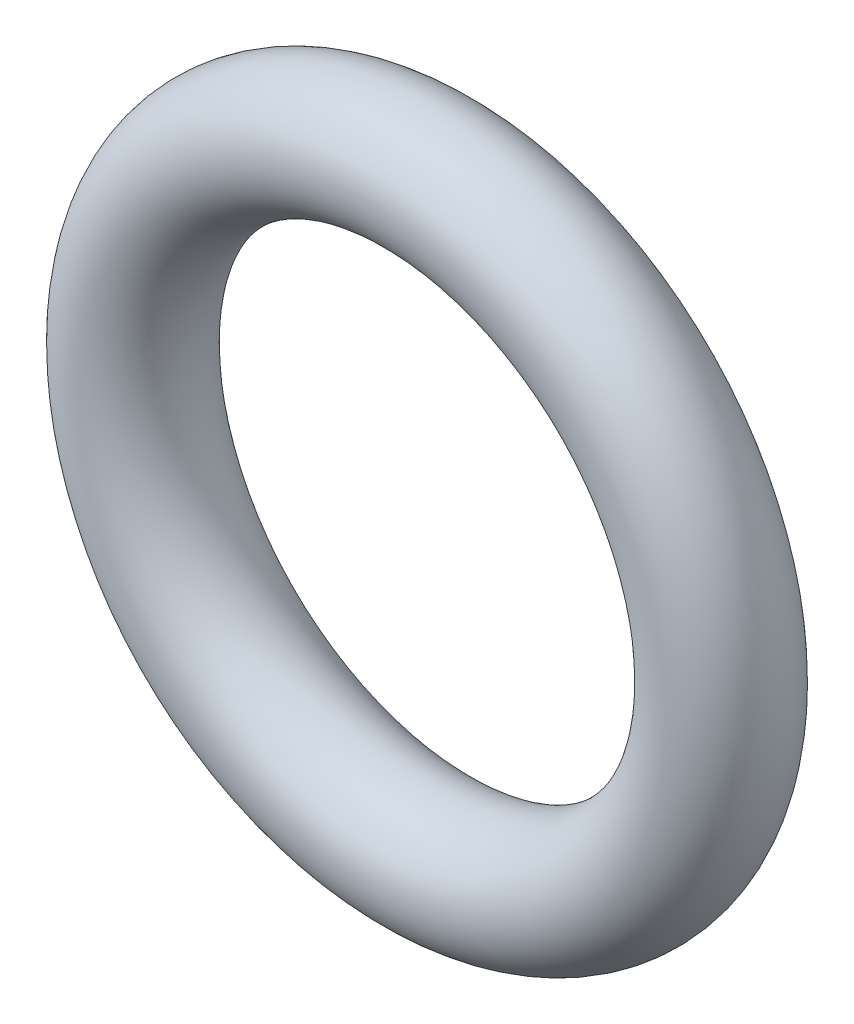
from build123d import *

# Parameters (mm, degrees)
SKETCH2_R = 0.8


with BuildPart() as part:
    # Sweep1: sweep along a path in Sketch1
    with BuildLine(Plane.XY) as sweep1_path:
        CenterArc((0, 0), 3.05, 0, 360)
    # Sketch2 → Sweep1 (sweep)
    with BuildSketch(Plane(origin=(0, 0, 0), x_dir=(1, 0, 0), z_dir=(0, 1, 0))):
        with Locations((-3.85, 0)):
            Circle(SKETCH2_R)
    sweep(path=sweep1_path.line)


solid = part.part
